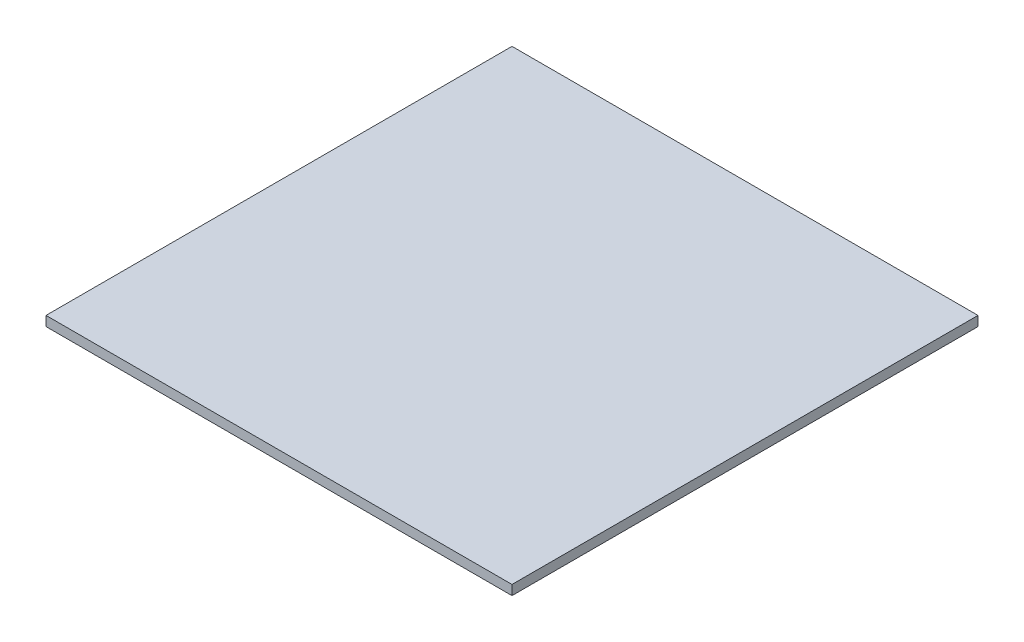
from build123d import *

# Parameters (mm, degrees)
SKETCH1_W            = 6.35
SKETCH1_H            = 304.8
PANEL_OR_BLOCK_DEPTH = 304.8


with BuildPart() as part:
    # Sketch1 → Panel_or_block (new body)
    with BuildSketch(Plane.YZ):
        with Locations((-155.575, 0)):
            Rectangle(SKETCH1_W, SKETCH1_H)
    extrude(amount=PANEL_OR_BLOCK_DEPTH)


solid = part.part
